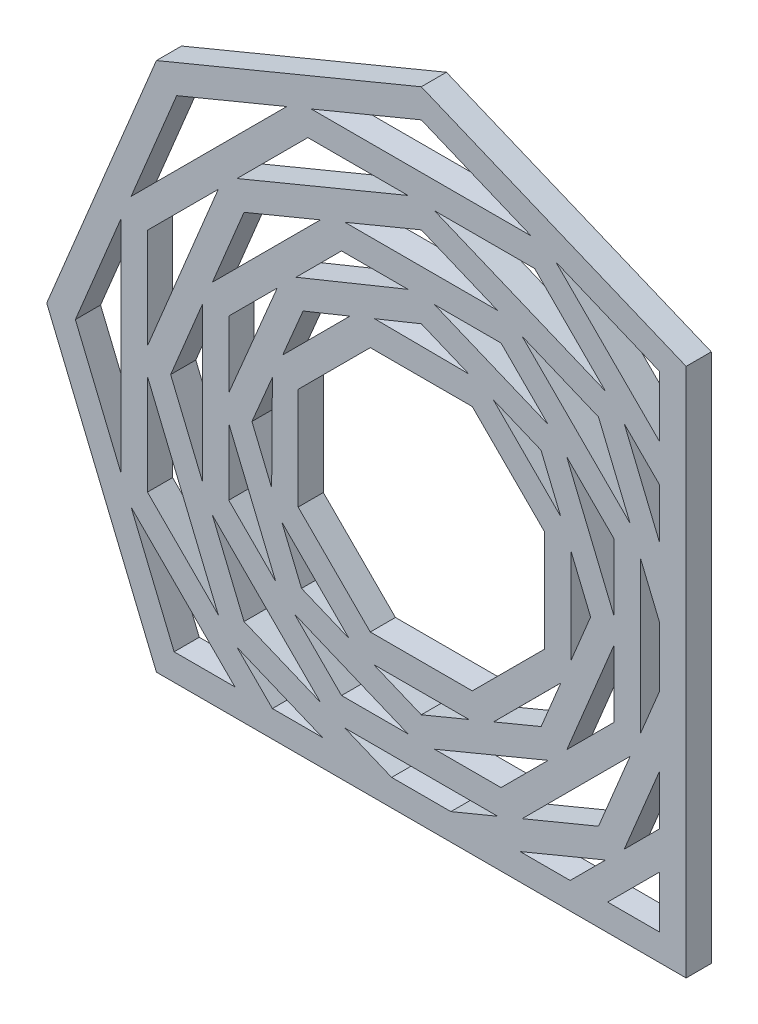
from build123d import *

# Parameters (mm, degrees)
BOSS_EXTRUDE3_DEPTH = 19
CUT_EXTRUDE4_DEPTH  = 32
SCALE1_SCALE        = 0.75714286


with BuildPart() as part:
    # Sketch1 → Boss-Extrude3 (new body)
    with BuildSketch(Plane.XY):
        Polygon((-570.614108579, 528.205306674), (-770.614109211, 445.362592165), (-853.456819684, 245.362592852), (-770.6141076, 45.362593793), (-370.6141076, 45.362593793), (-370.6141076, 445.362593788), align=None)
    extrude(amount=BOSS_EXTRUDE3_DEPTH)

    # Sketch2 → Cut-Extrude4 (cut)
    with BuildSketch(Plane.XY.offset(19)):
        Polygon((-477.635617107, 283.864126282), (-532.094278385, 338.327933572), (-609.114094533, 338.331572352), (-663.577901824, 283.872911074), (-663.581540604, 206.853094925), (-609.122879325, 152.389287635), (-532.103063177, 152.385648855), (-477.639255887, 206.844310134), align=None)
        Polygon((-711.316165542, 65.362593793), (-789.731038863, 143.777467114), (-757.250534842, 65.362593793), align=None)
        Polygon((-436.783619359, 111.532105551), (-412.893252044, 169.208554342), (-494.460068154, 87.641738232), align=None)
        Polygon((-580.614107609, 390.737117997), (-630.830207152, 390.737117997), (-665.226931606, 356.340393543), align=None)
        Polygon((-715.988631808, 185.14649424), (-680.480487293, 149.638349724), (-715.988631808, 235.36259379), align=None)
        Polygon((-480.094091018, 155.049048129), (-465.20932299, 191.043624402), (-516.038998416, 140.135456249), align=None)
        Polygon((-390.6141076, 104.66053585), (-429.912049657, 65.362593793), (-390.6141076, 65.362593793), align=None)
        Polygon((-458.196320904, 65.362593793), (-431.476282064, 92.082632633), (-495.984162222, 65.362593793), align=None)
        Polygon((-474.889863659, 355.228973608), (-510.398008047, 390.737117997), (-560.614107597, 390.737117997), align=None)
        Polygon((-534.634242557, 358.328061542), (-570.591539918, 373.222061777), (-605.895445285, 358.870351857), align=None)
        Polygon((-624.491283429, 351.270968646), (-659.891344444, 336.919990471), (-675.272732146, 300.444257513), align=None)
        Polygon((-797.38470751, 162.255057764), (-797.38470751, 328.470129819), (-831.808975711, 245.362592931), align=None)
        Polygon((-789.731039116, 346.947720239), (-672.199234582, 464.479524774), (-755.306771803, 430.055254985), align=None)
        Polygon((-735.988631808, 303.039042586), (-759.878999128, 245.362593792), (-735.988631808, 187.686144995), align=None)
        Polygon((-645.244052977, 65.362593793), (-709.751933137, 92.082632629), (-683.0318943, 65.362593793), align=None)
        Polygon((-704.44459584, 379.193082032), (-728.334963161, 321.516633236), (-646.768147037, 403.08344936), align=None)
        Polygon((-390.6141076, 319.992539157), (-390.6141076, 357.780380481), (-417.334146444, 384.500419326), align=None)
        Polygon((-777.384707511, 235.36259379), (-777.384707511, 159.715407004), (-723.894068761, 106.224768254), align=None)
        Polygon((-723.894068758, 384.500419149), (-777.384707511, 331.009780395), (-777.384707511, 255.362593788), align=None)
        Polygon((-656.261295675, 452.133192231), (-709.751932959, 398.642554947), (-580.614109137, 452.133192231), align=None)
        Polygon((-480.197200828, 335.779500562), (-516.156628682, 350.674383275), (-465.298875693, 299.811761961), align=None)
        Polygon((-625.059331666, 140.04572818), (-675.933979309, 190.924627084), (-661.031014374, 154.945687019), align=None)
        Polygon((-487.506571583, 472.133193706), (-570.614108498, 506.557462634), (-653.721643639, 472.133193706), align=None)
        Polygon((-405.239583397, 187.686144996), (-390.6141076, 222.995167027), (-390.6141076, 267.730020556), (-405.239583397, 303.039042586), align=None)
        Polygon((-510.398008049, 99.988069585), (-474.78908887, 135.596988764), (-560.614107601, 99.988069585), align=None)
        Polygon((-457.645208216, 281.334174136), (-457.566579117, 209.525425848), (-442.746098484, 245.364541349), align=None)
        Polygon((-548.24668082, 65.362593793), (-512.937658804, 79.988069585), (-628.290556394, 79.988069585), (-592.981534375, 65.362593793), align=None)
        Polygon((-425.239583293, 255.362593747), (-425.239583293, 305.578693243), (-460.747727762, 341.086837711), align=None)
        Polygon((-715.988631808, 255.362593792), (-679.372501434, 342.194823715), (-715.988631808, 305.578693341), align=None)
        Polygon((-704.444595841, 111.532105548), (-646.768147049, 87.641738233), (-728.334963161, 169.208554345), align=None)
        Polygon((-630.830207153, 99.988069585), (-580.614107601, 99.988069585), (-666.338351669, 135.4962141), align=None)
        Polygon((-698.491396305, 245.383049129), (-683.587656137, 209.402237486), (-683.044985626, 281.923863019), align=None)
        Polygon((-390.6141076, 132.944807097), (-390.6141076, 170.732648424), (-417.334146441, 106.224768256), align=None)
        Polygon((-606.58174417, 132.39206084), (-570.612165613, 117.492973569), (-534.511828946, 132.471053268), align=None)
        Polygon((-570.614107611, 434.627485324), (-628.290556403, 410.737118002), (-512.937658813, 410.737118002), align=None)
        Polygon((-436.78361936, 379.193082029), (-494.460068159, 403.083449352), (-412.893252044, 321.516633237), align=None)
        Polygon((-431.476280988, 398.642553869), (-484.96691935, 452.133192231), (-560.614105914, 452.133192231), align=None)
        Polygon((-425.239583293, 235.362593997), (-460.647531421, 149.738546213), (-425.239583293, 185.14649434), align=None)
        Polygon((-390.6141076, 386.064651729), (-390.6141076, 431.99902103), (-469.028980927, 464.479525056), align=None)
    extrude(amount=-CUT_EXTRUDE4_DEPTH, mode=Mode.SUBTRACT)


with BuildPart() as part_1:
    # Scale1: scaled about (-587.810207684, 262.607928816, 9.5)
    add(part.part.scale(SCALE1_SCALE).moved(Location((-142.753905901, 63.776210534, 2.30714283))))


solid = part_1.part
